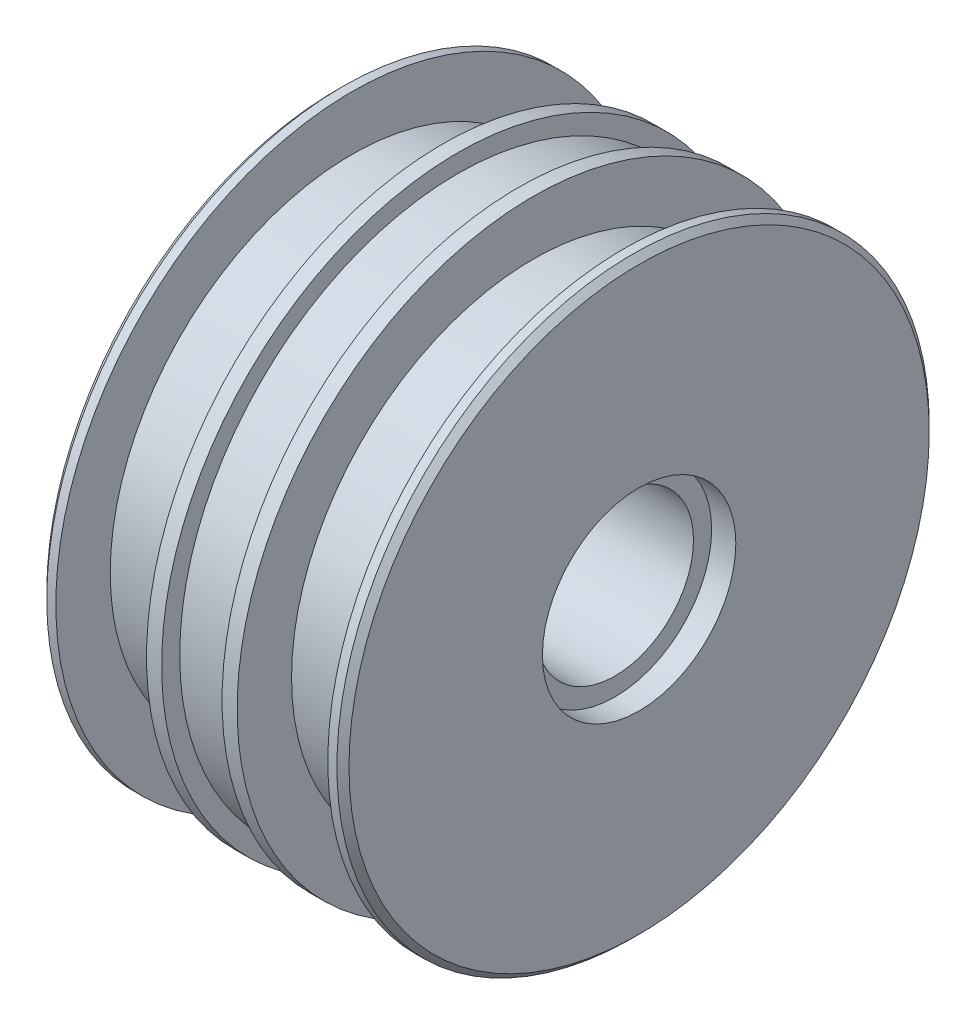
ISO-10303-21;
HEADER;
FILE_DESCRIPTION(('STEP AP214'),'2;1');
FILE_NAME('part.step','',(''),(''),'','','');
FILE_SCHEMA(('AUTOMOTIVE_DESIGN { 1 0 10303 214 1 1 1 1 }'));
ENDSEC;
DATA;
#1=APPLICATION_CONTEXT('core data for automotive mechanical design processes');
#2=APPLICATION_PROTOCOL_DEFINITION('international standard','automotive_design',2000,#1);
#3=PRODUCT_CONTEXT('',#1,'mechanical');
#4=PRODUCT('Part','Part','',(#3));
#5=PRODUCT_RELATED_PRODUCT_CATEGORY('part','',(#4));
#6=PRODUCT_DEFINITION_FORMATION('','',#4);
#7=PRODUCT_DEFINITION_CONTEXT('part definition',#1,'design');
#8=PRODUCT_DEFINITION('design','',#6,#7);
#9=PRODUCT_DEFINITION_SHAPE('','',#8);
#10=(LENGTH_UNIT() NAMED_UNIT(*) SI_UNIT(.MILLI.,.METRE.));
#11=(NAMED_UNIT(*) PLANE_ANGLE_UNIT() SI_UNIT($,.RADIAN.));
#12=(NAMED_UNIT(*) SI_UNIT($,.STERADIAN.) SOLID_ANGLE_UNIT());
#13=UNCERTAINTY_MEASURE_WITH_UNIT(LENGTH_MEASURE(1.E-05),#10,'distance_accuracy_value','');
#14=(GEOMETRIC_REPRESENTATION_CONTEXT(3) GLOBAL_UNCERTAINTY_ASSIGNED_CONTEXT((#13)) GLOBAL_UNIT_ASSIGNED_CONTEXT((#10,
#11,#12)) REPRESENTATION_CONTEXT('',''));
#15=CARTESIAN_POINT('',(0.,0.,0.));
#16=DIRECTION('',(0.,0.,1.));
#17=DIRECTION('',(1.,0.,0.));
#18=AXIS2_PLACEMENT_3D('',#15,#16,#17);
#19=CARTESIAN_POINT('',(0.,0.,0.));
#20=DIRECTION('',(1.,0.,0.));
#21=DIRECTION('',(0.,0.,-1.));
#22=AXIS2_PLACEMENT_3D('',#19,#20,#21);
#23=CYLINDRICAL_SURFACE('',#22,6.5);
#24=CARTESIAN_POINT('',(0.,0.,0.));
#25=DIRECTION('',(1.,0.,0.));
#26=DIRECTION('',(0.,0.,-1.));
#27=AXIS2_PLACEMENT_3D('',#24,#25,#26);
#28=CIRCLE('',#27,6.5);
#29=CARTESIAN_POINT('',(0.,0.,-6.5));
#30=VERTEX_POINT('',#29);
#31=EDGE_CURVE('E370',#30,#30,#28,.T.);
#32=ORIENTED_EDGE('',*,*,#31,.F.);
#33=EDGE_LOOP('',(#32));
#34=FACE_BOUND('',#33,.T.);
#35=CARTESIAN_POINT('',(23.,0.,0.));
#36=DIRECTION('',(1.,0.,0.));
#37=DIRECTION('',(0.,0.,-1.));
#38=AXIS2_PLACEMENT_3D('',#35,#36,#37);
#39=CIRCLE('',#38,6.5);
#40=CARTESIAN_POINT('',(23.,0.,-6.5));
#41=VERTEX_POINT('',#40);
#42=EDGE_CURVE('E367',#41,#41,#39,.F.);
#43=ORIENTED_EDGE('',*,*,#42,.F.);
#44=EDGE_LOOP('',(#43));
#45=FACE_BOUND('',#44,.T.);
#46=ADVANCED_FACE('F346',(#34,#45),#23,.F.);
#47=CARTESIAN_POINT('',(25.,24.5,0.));
#48=DIRECTION('',(1.,0.,0.));
#49=DIRECTION('',(0.,0.,-1.));
#50=AXIS2_PLACEMENT_3D('',#47,#48,#49);
#51=PLANE('',#50);
#52=CARTESIAN_POINT('',(25.,0.,0.));
#53=DIRECTION('',(1.,0.,0.));
#54=DIRECTION('',(0.,0.,-1.));
#55=AXIS2_PLACEMENT_3D('',#52,#53,#54);
#56=CIRCLE('',#55,24.);
#57=CARTESIAN_POINT('',(25.,0.,-24.));
#58=VERTEX_POINT('',#57);
#59=EDGE_CURVE('E361',#58,#58,#56,.T.);
#60=ORIENTED_EDGE('',*,*,#59,.T.);
#61=EDGE_LOOP('',(#60));
#62=FACE_BOUND('',#61,.T.);
#63=CARTESIAN_POINT('',(25.,0.,0.));
#64=DIRECTION('',(1.,0.,0.));
#65=DIRECTION('',(0.,0.,-1.));
#66=AXIS2_PLACEMENT_3D('',#63,#64,#65);
#67=CIRCLE('',#66,8.);
#68=CARTESIAN_POINT('',(25.,0.,-8.));
#69=VERTEX_POINT('',#68);
#70=EDGE_CURVE('E411',#69,#69,#67,.T.);
#71=ORIENTED_EDGE('',*,*,#70,.F.);
#72=EDGE_LOOP('',(#71));
#73=FACE_BOUND('',#72,.T.);
#74=ADVANCED_FACE('F348',(#62,#73),#51,.T.);
#75=CARTESIAN_POINT('',(34.,0.,0.));
#76=DIRECTION('',(1.,0.,0.));
#77=DIRECTION('',(0.,0.,-1.));
#78=AXIS2_PLACEMENT_3D('',#75,#76,#77);
#79=CYLINDRICAL_SURFACE('',#78,24.5);
#80=CARTESIAN_POINT('',(24.5,0.,0.));
#81=DIRECTION('',(1.,0.,0.));
#82=DIRECTION('',(0.,0.,-1.));
#83=AXIS2_PLACEMENT_3D('',#80,#81,#82);
#84=CIRCLE('',#83,24.5);
#85=CARTESIAN_POINT('',(24.5,0.,-24.5));
#86=VERTEX_POINT('',#85);
#87=EDGE_CURVE('E357',#86,#86,#84,.F.);
#88=ORIENTED_EDGE('',*,*,#87,.T.);
#89=EDGE_LOOP('',(#88));
#90=FACE_BOUND('',#89,.T.);
#91=CARTESIAN_POINT('',(23.75,0.,0.));
#92=DIRECTION('',(1.,0.,0.));
#93=DIRECTION('',(0.,0.,-1.));
#94=AXIS2_PLACEMENT_3D('',#91,#92,#93);
#95=CIRCLE('',#94,24.5);
#96=CARTESIAN_POINT('',(23.75,0.,-24.5));
#97=VERTEX_POINT('',#96);
#98=EDGE_CURVE('E366',#97,#97,#95,.T.);
#99=ORIENTED_EDGE('',*,*,#98,.T.);
#100=EDGE_LOOP('',(#99));
#101=FACE_BOUND('',#100,.T.);
#102=ADVANCED_FACE('F418',(#90,#101),#79,.T.);
#103=CARTESIAN_POINT('',(23.75,20.,0.));
#104=DIRECTION('',(-1.,0.,0.));
#105=DIRECTION('',(0.,0.,1.));
#106=AXIS2_PLACEMENT_3D('',#103,#104,#105);
#107=PLANE('',#106);
#108=CARTESIAN_POINT('',(23.75,0.,0.));
#109=DIRECTION('',(1.,0.,0.));
#110=DIRECTION('',(0.,0.,-1.));
#111=AXIS2_PLACEMENT_3D('',#108,#109,#110);
#112=CIRCLE('',#111,20.);
#113=CARTESIAN_POINT('',(23.75,0.,-20.));
#114=VERTEX_POINT('',#113);
#115=EDGE_CURVE('E374',#114,#114,#112,.T.);
#116=ORIENTED_EDGE('',*,*,#115,.T.);
#117=EDGE_LOOP('',(#116));
#118=FACE_BOUND('',#117,.T.);
#119=ORIENTED_EDGE('',*,*,#98,.F.);
#120=EDGE_LOOP('',(#119));
#121=FACE_BOUND('',#120,.T.);
#122=ADVANCED_FACE('F424',(#118,#121),#107,.T.);
#123=CARTESIAN_POINT('',(34.,0.,0.));
#124=DIRECTION('',(1.,0.,0.));
#125=DIRECTION('',(0.,0.,-1.));
#126=AXIS2_PLACEMENT_3D('',#123,#124,#125);
#127=CYLINDRICAL_SURFACE('',#126,20.);
#128=CARTESIAN_POINT('',(16.25,0.,0.));
#129=DIRECTION('',(1.,0.,0.));
#130=DIRECTION('',(0.,0.,-1.));
#131=AXIS2_PLACEMENT_3D('',#128,#129,#130);
#132=CIRCLE('',#131,20.);
#133=CARTESIAN_POINT('',(16.25,0.,-20.));
#134=VERTEX_POINT('',#133);
#135=EDGE_CURVE('E377',#134,#134,#132,.T.);
#136=ORIENTED_EDGE('',*,*,#135,.T.);
#137=EDGE_LOOP('',(#136));
#138=FACE_BOUND('',#137,.T.);
#139=ORIENTED_EDGE('',*,*,#115,.F.);
#140=EDGE_LOOP('',(#139));
#141=FACE_BOUND('',#140,.T.);
#142=ADVANCED_FACE('F490',(#138,#141),#127,.T.);
#143=CARTESIAN_POINT('',(16.25,24.5,0.));
#144=DIRECTION('',(1.,0.,0.));
#145=DIRECTION('',(0.,0.,-1.));
#146=AXIS2_PLACEMENT_3D('',#143,#144,#145);
#147=PLANE('',#146);
#148=CARTESIAN_POINT('',(16.25,0.,0.));
#149=DIRECTION('',(1.,0.,0.));
#150=DIRECTION('',(0.,0.,-1.));
#151=AXIS2_PLACEMENT_3D('',#148,#149,#150);
#152=CIRCLE('',#151,24.5);
#153=CARTESIAN_POINT('',(16.25,0.,-24.5));
#154=VERTEX_POINT('',#153);
#155=EDGE_CURVE('E380',#154,#154,#152,.T.);
#156=ORIENTED_EDGE('',*,*,#155,.T.);
#157=EDGE_LOOP('',(#156));
#158=FACE_BOUND('',#157,.T.);
#159=ORIENTED_EDGE('',*,*,#135,.F.);
#160=EDGE_LOOP('',(#159));
#161=FACE_BOUND('',#160,.T.);
#162=ADVANCED_FACE('F486',(#158,#161),#147,.T.);
#163=CARTESIAN_POINT('',(34.,0.,0.));
#164=DIRECTION('',(1.,0.,0.));
#165=DIRECTION('',(0.,0.,-1.));
#166=AXIS2_PLACEMENT_3D('',#163,#164,#165);
#167=CYLINDRICAL_SURFACE('',#166,24.5);
#168=CARTESIAN_POINT('',(15.,0.,0.));
#169=DIRECTION('',(1.,0.,0.));
#170=DIRECTION('',(0.,0.,-1.));
#171=AXIS2_PLACEMENT_3D('',#168,#169,#170);
#172=CIRCLE('',#171,24.5);
#173=CARTESIAN_POINT('',(15.,0.,-24.5));
#174=VERTEX_POINT('',#173);
#175=EDGE_CURVE('E383',#174,#174,#172,.T.);
#176=ORIENTED_EDGE('',*,*,#175,.T.);
#177=EDGE_LOOP('',(#176));
#178=FACE_BOUND('',#177,.T.);
#179=ORIENTED_EDGE('',*,*,#155,.F.);
#180=EDGE_LOOP('',(#179));
#181=FACE_BOUND('',#180,.T.);
#182=ADVANCED_FACE('F482',(#178,#181),#167,.T.);
#183=CARTESIAN_POINT('',(15.,23.,0.));
#184=DIRECTION('',(-1.,0.,0.));
#185=DIRECTION('',(0.,0.,1.));
#186=AXIS2_PLACEMENT_3D('',#183,#184,#185);
#187=PLANE('',#186);
#188=CARTESIAN_POINT('',(15.,0.,0.));
#189=DIRECTION('',(1.,0.,0.));
#190=DIRECTION('',(0.,0.,-1.));
#191=AXIS2_PLACEMENT_3D('',#188,#189,#190);
#192=CIRCLE('',#191,23.);
#193=CARTESIAN_POINT('',(15.,0.,-23.));
#194=VERTEX_POINT('',#193);
#195=EDGE_CURVE('E386',#194,#194,#192,.T.);
#196=ORIENTED_EDGE('',*,*,#195,.T.);
#197=EDGE_LOOP('',(#196));
#198=FACE_BOUND('',#197,.T.);
#199=ORIENTED_EDGE('',*,*,#175,.F.);
#200=EDGE_LOOP('',(#199));
#201=FACE_BOUND('',#200,.T.);
#202=ADVANCED_FACE('F478',(#198,#201),#187,.T.);
#203=CARTESIAN_POINT('',(34.,0.,0.));
#204=DIRECTION('',(1.,0.,0.));
#205=DIRECTION('',(0.,0.,-1.));
#206=AXIS2_PLACEMENT_3D('',#203,#204,#205);
#207=CYLINDRICAL_SURFACE('',#206,23.);
#208=CARTESIAN_POINT('',(10.,0.,0.));
#209=DIRECTION('',(1.,0.,0.));
#210=DIRECTION('',(0.,0.,-1.));
#211=AXIS2_PLACEMENT_3D('',#208,#209,#210);
#212=CIRCLE('',#211,23.);
#213=CARTESIAN_POINT('',(10.,0.,-23.));
#214=VERTEX_POINT('',#213);
#215=EDGE_CURVE('E389',#214,#214,#212,.T.);
#216=ORIENTED_EDGE('',*,*,#215,.T.);
#217=EDGE_LOOP('',(#216));
#218=FACE_BOUND('',#217,.T.);
#219=ORIENTED_EDGE('',*,*,#195,.F.);
#220=EDGE_LOOP('',(#219));
#221=FACE_BOUND('',#220,.T.);
#222=ADVANCED_FACE('F474',(#218,#221),#207,.T.);
#223=CARTESIAN_POINT('',(10.,24.5,0.));
#224=DIRECTION('',(1.,0.,0.));
#225=DIRECTION('',(0.,0.,-1.));
#226=AXIS2_PLACEMENT_3D('',#223,#224,#225);
#227=PLANE('',#226);
#228=CARTESIAN_POINT('',(10.,0.,0.));
#229=DIRECTION('',(1.,0.,0.));
#230=DIRECTION('',(0.,0.,-1.));
#231=AXIS2_PLACEMENT_3D('',#228,#229,#230);
#232=CIRCLE('',#231,24.5);
#233=CARTESIAN_POINT('',(10.,0.,-24.5));
#234=VERTEX_POINT('',#233);
#235=EDGE_CURVE('E392',#234,#234,#232,.T.);
#236=ORIENTED_EDGE('',*,*,#235,.T.);
#237=EDGE_LOOP('',(#236));
#238=FACE_BOUND('',#237,.T.);
#239=ORIENTED_EDGE('',*,*,#215,.F.);
#240=EDGE_LOOP('',(#239));
#241=FACE_BOUND('',#240,.T.);
#242=ADVANCED_FACE('F470',(#238,#241),#227,.T.);
#243=CARTESIAN_POINT('',(34.,0.,0.));
#244=DIRECTION('',(1.,0.,0.));
#245=DIRECTION('',(0.,0.,-1.));
#246=AXIS2_PLACEMENT_3D('',#243,#244,#245);
#247=CYLINDRICAL_SURFACE('',#246,24.5);
#248=CARTESIAN_POINT('',(8.75,0.,0.));
#249=DIRECTION('',(1.,0.,0.));
#250=DIRECTION('',(0.,0.,-1.));
#251=AXIS2_PLACEMENT_3D('',#248,#249,#250);
#252=CIRCLE('',#251,24.5);
#253=CARTESIAN_POINT('',(8.75,0.,-24.5));
#254=VERTEX_POINT('',#253);
#255=EDGE_CURVE('E395',#254,#254,#252,.T.);
#256=ORIENTED_EDGE('',*,*,#255,.T.);
#257=EDGE_LOOP('',(#256));
#258=FACE_BOUND('',#257,.T.);
#259=ORIENTED_EDGE('',*,*,#235,.F.);
#260=EDGE_LOOP('',(#259));
#261=FACE_BOUND('',#260,.T.);
#262=ADVANCED_FACE('F466',(#258,#261),#247,.T.);
#263=CARTESIAN_POINT('',(8.75,20.,0.));
#264=DIRECTION('',(-1.,0.,0.));
#265=DIRECTION('',(0.,0.,1.));
#266=AXIS2_PLACEMENT_3D('',#263,#264,#265);
#267=PLANE('',#266);
#268=CARTESIAN_POINT('',(8.75,0.,0.));
#269=DIRECTION('',(1.,0.,0.));
#270=DIRECTION('',(0.,0.,-1.));
#271=AXIS2_PLACEMENT_3D('',#268,#269,#270);
#272=CIRCLE('',#271,20.);
#273=CARTESIAN_POINT('',(8.75,0.,-20.));
#274=VERTEX_POINT('',#273);
#275=EDGE_CURVE('E398',#274,#274,#272,.T.);
#276=ORIENTED_EDGE('',*,*,#275,.T.);
#277=EDGE_LOOP('',(#276));
#278=FACE_BOUND('',#277,.T.);
#279=ORIENTED_EDGE('',*,*,#255,.F.);
#280=EDGE_LOOP('',(#279));
#281=FACE_BOUND('',#280,.T.);
#282=ADVANCED_FACE('F462',(#278,#281),#267,.T.);
#283=CARTESIAN_POINT('',(34.,0.,0.));
#284=DIRECTION('',(1.,0.,0.));
#285=DIRECTION('',(0.,0.,-1.));
#286=AXIS2_PLACEMENT_3D('',#283,#284,#285);
#287=CYLINDRICAL_SURFACE('',#286,20.);
#288=CARTESIAN_POINT('',(1.25,0.,0.));
#289=DIRECTION('',(1.,0.,0.));
#290=DIRECTION('',(0.,0.,-1.));
#291=AXIS2_PLACEMENT_3D('',#288,#289,#290);
#292=CIRCLE('',#291,20.);
#293=CARTESIAN_POINT('',(1.25,0.,-20.));
#294=VERTEX_POINT('',#293);
#295=EDGE_CURVE('E401',#294,#294,#292,.T.);
#296=ORIENTED_EDGE('',*,*,#295,.T.);
#297=EDGE_LOOP('',(#296));
#298=FACE_BOUND('',#297,.T.);
#299=ORIENTED_EDGE('',*,*,#275,.F.);
#300=EDGE_LOOP('',(#299));
#301=FACE_BOUND('',#300,.T.);
#302=ADVANCED_FACE('F458',(#298,#301),#287,.T.);
#303=CARTESIAN_POINT('',(1.25,24.5,0.));
#304=DIRECTION('',(1.,0.,0.));
#305=DIRECTION('',(0.,0.,-1.));
#306=AXIS2_PLACEMENT_3D('',#303,#304,#305);
#307=PLANE('',#306);
#308=CARTESIAN_POINT('',(1.25,0.,0.));
#309=DIRECTION('',(1.,0.,0.));
#310=DIRECTION('',(0.,0.,-1.));
#311=AXIS2_PLACEMENT_3D('',#308,#309,#310);
#312=CIRCLE('',#311,24.5);
#313=CARTESIAN_POINT('',(1.25,0.,-24.5));
#314=VERTEX_POINT('',#313);
#315=EDGE_CURVE('E404',#314,#314,#312,.T.);
#316=ORIENTED_EDGE('',*,*,#315,.T.);
#317=EDGE_LOOP('',(#316));
#318=FACE_BOUND('',#317,.T.);
#319=ORIENTED_EDGE('',*,*,#295,.F.);
#320=EDGE_LOOP('',(#319));
#321=FACE_BOUND('',#320,.T.);
#322=ADVANCED_FACE('F455',(#318,#321),#307,.T.);
#323=CARTESIAN_POINT('',(34.,0.,0.));
#324=DIRECTION('',(1.,0.,0.));
#325=DIRECTION('',(0.,0.,-1.));
#326=AXIS2_PLACEMENT_3D('',#323,#324,#325);
#327=CYLINDRICAL_SURFACE('',#326,24.5);
#328=CARTESIAN_POINT('',(0.500000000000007,0.,0.));
#329=DIRECTION('',(-1.,0.,0.));
#330=DIRECTION('',(0.,0.,1.));
#331=AXIS2_PLACEMENT_3D('',#328,#329,#330);
#332=CIRCLE('',#331,24.5);
#333=CARTESIAN_POINT('',(0.500000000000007,0.,24.5));
#334=VERTEX_POINT('',#333);
#335=EDGE_CURVE('E353',#334,#334,#332,.F.);
#336=ORIENTED_EDGE('',*,*,#335,.T.);
#337=EDGE_LOOP('',(#336));
#338=FACE_BOUND('',#337,.T.);
#339=ORIENTED_EDGE('',*,*,#315,.F.);
#340=EDGE_LOOP('',(#339));
#341=FACE_BOUND('',#340,.T.);
#342=ADVANCED_FACE('F452',(#338,#341),#327,.T.);
#343=CARTESIAN_POINT('',(0.,0.,0.));
#344=DIRECTION('',(-1.,0.,0.));
#345=DIRECTION('',(0.,0.,1.));
#346=AXIS2_PLACEMENT_3D('',#343,#344,#345);
#347=PLANE('',#346);
#348=CARTESIAN_POINT('',(0.,0.,0.));
#349=DIRECTION('',(-1.,0.,0.));
#350=DIRECTION('',(0.,0.,1.));
#351=AXIS2_PLACEMENT_3D('',#348,#349,#350);
#352=CIRCLE('',#351,24.);
#353=CARTESIAN_POINT('',(0.,0.,24.));
#354=VERTEX_POINT('',#353);
#355=EDGE_CURVE('E10',#354,#354,#352,.T.);
#356=ORIENTED_EDGE('',*,*,#355,.T.);
#357=EDGE_LOOP('',(#356));
#358=FACE_BOUND('',#357,.T.);
#359=ORIENTED_EDGE('',*,*,#31,.T.);
#360=EDGE_LOOP('',(#359));
#361=FACE_BOUND('',#360,.T.);
#362=ADVANCED_FACE('F448',(#358,#361),#347,.T.);
#363=CARTESIAN_POINT('',(23.,0.,0.));
#364=DIRECTION('',(1.,0.,0.));
#365=DIRECTION('',(0.,0.,-1.));
#366=AXIS2_PLACEMENT_3D('',#363,#364,#365);
#367=PLANE('',#366);
#368=CARTESIAN_POINT('',(23.,0.,0.));
#369=DIRECTION('',(1.,0.,0.));
#370=DIRECTION('',(0.,0.,-1.));
#371=AXIS2_PLACEMENT_3D('',#368,#369,#370);
#372=CIRCLE('',#371,8.);
#373=CARTESIAN_POINT('',(23.,0.,-8.));
#374=VERTEX_POINT('',#373);
#375=EDGE_CURVE('E371',#374,#374,#372,.T.);
#376=ORIENTED_EDGE('',*,*,#375,.T.);
#377=EDGE_LOOP('',(#376));
#378=FACE_BOUND('',#377,.T.);
#379=ORIENTED_EDGE('',*,*,#42,.T.);
#380=EDGE_LOOP('',(#379));
#381=FACE_BOUND('',#380,.T.);
#382=ADVANCED_FACE('F442',(#378,#381),#367,.T.);
#383=CARTESIAN_POINT('',(23.,0.,0.));
#384=DIRECTION('',(1.,0.,0.));
#385=DIRECTION('',(0.,0.,-1.));
#386=AXIS2_PLACEMENT_3D('',#383,#384,#385);
#387=CYLINDRICAL_SURFACE('',#386,8.);
#388=ORIENTED_EDGE('',*,*,#375,.F.);
#389=EDGE_LOOP('',(#388));
#390=FACE_BOUND('',#389,.T.);
#391=ORIENTED_EDGE('',*,*,#70,.T.);
#392=EDGE_LOOP('',(#391));
#393=FACE_BOUND('',#392,.T.);
#394=ADVANCED_FACE('F415',(#390,#393),#387,.F.);
#395=CARTESIAN_POINT('',(25.,0.,0.));
#396=DIRECTION('',(-1.,0.,0.));
#397=DIRECTION('',(0.,0.,1.));
#398=AXIS2_PLACEMENT_3D('',#395,#396,#397);
#399=CONICAL_SURFACE('',#398,24.,0.785398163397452);
#400=ORIENTED_EDGE('',*,*,#87,.F.);
#401=EDGE_LOOP('',(#400));
#402=FACE_BOUND('',#401,.T.);
#403=ORIENTED_EDGE('',*,*,#59,.F.);
#404=EDGE_LOOP('',(#403));
#405=FACE_BOUND('',#404,.T.);
#406=ADVANCED_FACE('F431',(#402,#405),#399,.T.);
#407=CARTESIAN_POINT('',(0.500000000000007,0.,0.));
#408=DIRECTION('',(1.,0.,0.));
#409=DIRECTION('',(0.,0.,-1.));
#410=AXIS2_PLACEMENT_3D('',#407,#408,#409);
#411=CONICAL_SURFACE('',#410,24.5,0.785398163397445);
#412=ORIENTED_EDGE('',*,*,#355,.F.);
#413=EDGE_LOOP('',(#412));
#414=FACE_BOUND('',#413,.T.);
#415=ORIENTED_EDGE('',*,*,#335,.F.);
#416=EDGE_LOOP('',(#415));
#417=FACE_BOUND('',#416,.T.);
#418=ADVANCED_FACE('F433',(#414,#417),#411,.T.);
#419=CLOSED_SHELL('',(#46,#74,#102,#122,#142,#162,#182,#202,#222,#242,#262,#282,#302,#322,#342,
#362,#382,#394,#406,#418));
#420=MANIFOLD_SOLID_BREP('B2',#419);
#421=ADVANCED_BREP_SHAPE_REPRESENTATION('',(#18,#420),#14);
#422=SHAPE_DEFINITION_REPRESENTATION(#9,#421);
ENDSEC;
END-ISO-10303-21;
